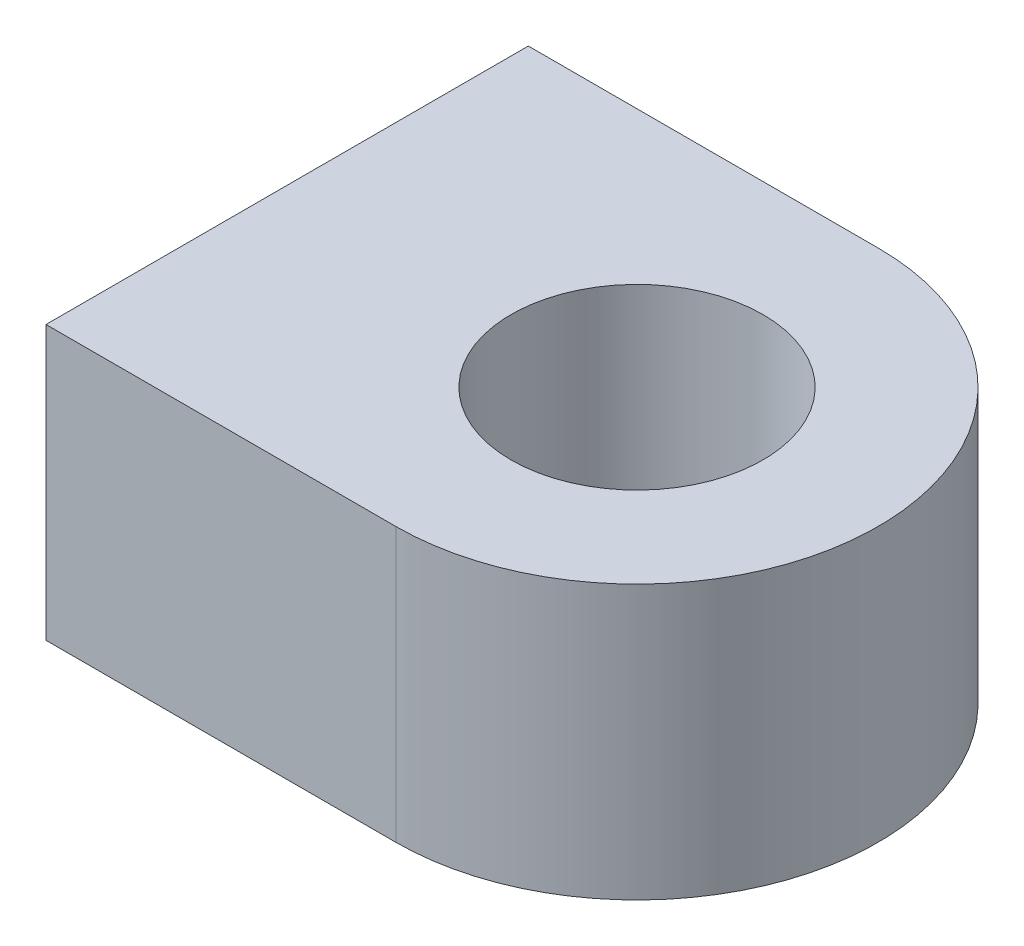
from build123d import *

# Parameters (mm, degrees)
SKETCH1_R           = 4.1275
SKETCH1_R_2         = 2.2225
BOSS_EXTRUDE1_DEPTH = 5.08
SKETCH2_R           = 4.1275
BOSS_EXTRUDE2_DEPTH = 0.762
BOSS_EXTRUDE3_START = -5.08
BOSS_EXTRUDE3_DEPTH = 5.08
BOSS_EXTRUDE5_START = -5.08
BOSS_EXTRUDE5_DEPTH = 5.08
CUT_EXTRUDE1_START  = -0.254
CUT_EXTRUDE1_DEPTH  = 0.254


with BuildPart() as part:
    # Sketch1 → Boss-Extrude1 (new body)
    with BuildSketch(Plane(origin=(0, 0, 0), x_dir=(1, 0, 0), z_dir=(0, 1, 0))):
        with Locations(Location((0, 0, 0), (0, 0, 270))):
            Circle(SKETCH1_R)
        with Locations(Location((0, 0, 0), (0, 0, 270))):
            Circle(SKETCH1_R_2, mode=Mode.SUBTRACT)
    extrude(amount=BOSS_EXTRUDE1_DEPTH)

    # Sketch2 → Boss-Extrude2 (add)
    with BuildSketch(Plane.XZ):
        with Locations(Location((0, 0, 0), (0, 0, 90))):
            Circle(SKETCH2_R)
    extrude(amount=-BOSS_EXTRUDE2_DEPTH)

    # Sketch3 → Boss-Extrude3 (add)
    with BuildSketch(Plane(origin=(0, 5.08, 0), x_dir=(1, 0, 0), z_dir=(0, 1, 0)).offset(BOSS_EXTRUDE3_START)):
        with BuildLine():
            Line((-6.1722, 4.1275), (-6.1722, -4.1275))
            Line((-6.1722, -4.1275), (0, -4.1275))
            ThreePointArc((0, -4.1275), (-4.1275, 0), (0, 4.1275))
            Line((0, 4.1275), (-6.1722, 4.1275))
        make_face()
    extrude(amount=BOSS_EXTRUDE3_DEPTH)

    # Sketch4 → Boss-Extrude5 (add)
    with BuildSketch(Plane(origin=(0, 5.08, 0), x_dir=(1, 0, 0), z_dir=(0, 1, 0)).offset(BOSS_EXTRUDE5_START)):
        with BuildLine():
            Line((0, -4.2545), (-6.1722, -4.2545))
            Line((-6.1722, -4.2545), (-6.1722, -4.1275))
            Line((-6.1722, -4.1275), (0, -4.1275))
            ThreePointArc((0, -4.1275), (4.1275, 0), (0, 4.1275))
            Line((0, 4.1275), (-6.1722, 4.1275))
            Line((-6.1722, 4.1275), (-6.1722, 4.2545))
            Line((-6.1722, 4.2545), (0, 4.2545))
            ThreePointArc((0, 4.2545), (4.2545, 0), (0, -4.2545))
        make_face()
    extrude(amount=BOSS_EXTRUDE5_DEPTH)

    # Sketch5 → Cut-Extrude1 (cut)
    with BuildSketch(Plane(origin=(0, 5.08, 0), x_dir=(1, 0, 0), z_dir=(0, 1, 0)).offset(CUT_EXTRUDE1_START)):
        with BuildLine():
            Line((-6.1722, 4.2545), (-6.1722, -4.2545))
            Line((-6.1722, -4.2545), (0, -4.2545))
            ThreePointArc((0, -4.2545), (4.2545, 0), (0, 4.2545))
            Line((0, 4.2545), (-6.1722, 4.2545))
        make_face()
    extrude(amount=CUT_EXTRUDE1_DEPTH, mode=Mode.SUBTRACT)


solid = part.part
